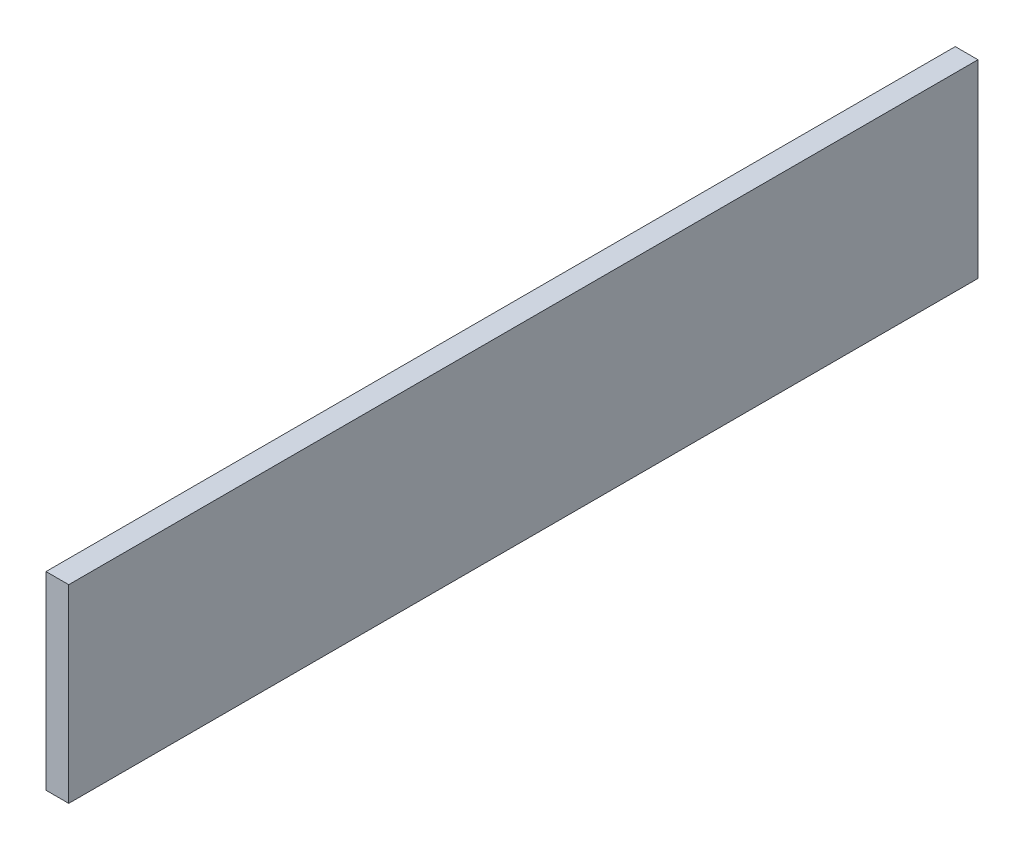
ISO-10303-21;
HEADER;
FILE_DESCRIPTION(('STEP AP214'),'2;1');
FILE_NAME('part.step','',(''),(''),'','','');
FILE_SCHEMA(('AUTOMOTIVE_DESIGN { 1 0 10303 214 1 1 1 1 }'));
ENDSEC;
DATA;
#1=APPLICATION_CONTEXT('core data for automotive mechanical design processes');
#2=APPLICATION_PROTOCOL_DEFINITION('international standard','automotive_design',2000,#1);
#3=PRODUCT_CONTEXT('',#1,'mechanical');
#4=PRODUCT('Part','Part','',(#3));
#5=PRODUCT_RELATED_PRODUCT_CATEGORY('part','',(#4));
#6=PRODUCT_DEFINITION_FORMATION('','',#4);
#7=PRODUCT_DEFINITION_CONTEXT('part definition',#1,'design');
#8=PRODUCT_DEFINITION('design','',#6,#7);
#9=PRODUCT_DEFINITION_SHAPE('','',#8);
#10=(LENGTH_UNIT() NAMED_UNIT(*) SI_UNIT(.MILLI.,.METRE.));
#11=(NAMED_UNIT(*) PLANE_ANGLE_UNIT() SI_UNIT($,.RADIAN.));
#12=(NAMED_UNIT(*) SI_UNIT($,.STERADIAN.) SOLID_ANGLE_UNIT());
#13=UNCERTAINTY_MEASURE_WITH_UNIT(LENGTH_MEASURE(1.E-05),#10,'distance_accuracy_value','');
#14=(GEOMETRIC_REPRESENTATION_CONTEXT(3) GLOBAL_UNCERTAINTY_ASSIGNED_CONTEXT((#13)) GLOBAL_UNIT_ASSIGNED_CONTEXT((#10,
#11,#12)) REPRESENTATION_CONTEXT('',''));
#15=CARTESIAN_POINT('',(0.,0.,0.));
#16=DIRECTION('',(0.,0.,1.));
#17=DIRECTION('',(1.,0.,0.));
#18=AXIS2_PLACEMENT_3D('',#15,#16,#17);
#19=CARTESIAN_POINT('',(1.5,120.,10.));
#20=DIRECTION('',(-1.,0.,0.));
#21=DIRECTION('',(0.,0.,1.));
#22=AXIS2_PLACEMENT_3D('',#19,#20,#21);
#23=PLANE('',#22);
#24=DIRECTION('',(0.,0.,-1.));
#25=VECTOR('',#24,1.);
#26=CARTESIAN_POINT('',(1.5,95.,10.));
#27=LINE('',#26,#25);
#28=CARTESIAN_POINT('',(1.5,95.,10.));
#29=VERTEX_POINT('',#28);
#30=CARTESIAN_POINT('',(1.5,95.,-110.));
#31=VERTEX_POINT('',#30);
#32=EDGE_CURVE('E90',#29,#31,#27,.T.);
#33=ORIENTED_EDGE('',*,*,#32,.T.);
#34=DIRECTION('',(0.,1.,0.));
#35=VECTOR('',#34,1.);
#36=CARTESIAN_POINT('',(1.5,120.,-110.));
#37=LINE('',#36,#35);
#38=CARTESIAN_POINT('',(1.5,120.,-110.));
#39=VERTEX_POINT('',#38);
#40=EDGE_CURVE('E85',#31,#39,#37,.T.);
#41=ORIENTED_EDGE('',*,*,#40,.T.);
#42=DIRECTION('',(0.,0.,-1.));
#43=VECTOR('',#42,1.);
#44=CARTESIAN_POINT('',(1.5,120.,10.));
#45=LINE('',#44,#43);
#46=CARTESIAN_POINT('',(1.5,120.,10.));
#47=VERTEX_POINT('',#46);
#48=EDGE_CURVE('E11',#47,#39,#45,.T.);
#49=ORIENTED_EDGE('',*,*,#48,.F.);
#50=DIRECTION('',(0.,1.,0.));
#51=VECTOR('',#50,1.);
#52=CARTESIAN_POINT('',(1.5,120.,10.));
#53=LINE('',#52,#51);
#54=EDGE_CURVE('E96',#29,#47,#53,.T.);
#55=ORIENTED_EDGE('',*,*,#54,.F.);
#56=EDGE_LOOP('',(#33,#41,#49,#55));
#57=FACE_BOUND('',#56,.T.);
#58=ADVANCED_FACE('F33',(#57),#23,.F.);
#59=CARTESIAN_POINT('',(1.5,120.,10.));
#60=DIRECTION('',(0.,-1.,0.));
#61=DIRECTION('',(0.,0.,-1.));
#62=AXIS2_PLACEMENT_3D('',#59,#60,#61);
#63=PLANE('',#62);
#64=ORIENTED_EDGE('',*,*,#48,.T.);
#65=DIRECTION('',(-1.,0.,0.));
#66=VECTOR('',#65,1.);
#67=CARTESIAN_POINT('',(1.5,120.,-110.));
#68=LINE('',#67,#66);
#69=CARTESIAN_POINT('',(-1.5,120.,-110.));
#70=VERTEX_POINT('',#69);
#71=EDGE_CURVE('E75',#39,#70,#68,.T.);
#72=ORIENTED_EDGE('',*,*,#71,.T.);
#73=DIRECTION('',(0.,0.,-1.));
#74=VECTOR('',#73,1.);
#75=CARTESIAN_POINT('',(-1.5,120.,10.));
#76=LINE('',#75,#74);
#77=CARTESIAN_POINT('',(-1.5,120.,10.));
#78=VERTEX_POINT('',#77);
#79=EDGE_CURVE('E40',#78,#70,#76,.T.);
#80=ORIENTED_EDGE('',*,*,#79,.F.);
#81=DIRECTION('',(-1.,0.,0.));
#82=VECTOR('',#81,1.);
#83=CARTESIAN_POINT('',(1.5,120.,10.));
#84=LINE('',#83,#82);
#85=EDGE_CURVE('E76',#47,#78,#84,.T.);
#86=ORIENTED_EDGE('',*,*,#85,.F.);
#87=EDGE_LOOP('',(#64,#72,#80,#86));
#88=FACE_BOUND('',#87,.T.);
#89=ADVANCED_FACE('F73',(#88),#63,.F.);
#90=CARTESIAN_POINT('',(-1.5,120.,10.));
#91=DIRECTION('',(1.,0.,0.));
#92=DIRECTION('',(0.,0.,-1.));
#93=AXIS2_PLACEMENT_3D('',#90,#91,#92);
#94=PLANE('',#93);
#95=ORIENTED_EDGE('',*,*,#79,.T.);
#96=DIRECTION('',(0.,-1.,0.));
#97=VECTOR('',#96,1.);
#98=CARTESIAN_POINT('',(-1.5,120.,-110.));
#99=LINE('',#98,#97);
#100=CARTESIAN_POINT('',(-1.5,95.,-110.));
#101=VERTEX_POINT('',#100);
#102=EDGE_CURVE('E88',#70,#101,#99,.T.);
#103=ORIENTED_EDGE('',*,*,#102,.T.);
#104=DIRECTION('',(0.,0.,-1.));
#105=VECTOR('',#104,1.);
#106=CARTESIAN_POINT('',(-1.5,95.,10.));
#107=LINE('',#106,#105);
#108=CARTESIAN_POINT('',(-1.5,95.,10.));
#109=VERTEX_POINT('',#108);
#110=EDGE_CURVE('E102',#109,#101,#107,.T.);
#111=ORIENTED_EDGE('',*,*,#110,.F.);
#112=DIRECTION('',(0.,-1.,0.));
#113=VECTOR('',#112,1.);
#114=CARTESIAN_POINT('',(-1.5,120.,10.));
#115=LINE('',#114,#113);
#116=EDGE_CURVE('E52',#78,#109,#115,.T.);
#117=ORIENTED_EDGE('',*,*,#116,.F.);
#118=EDGE_LOOP('',(#95,#103,#111,#117));
#119=FACE_BOUND('',#118,.T.);
#120=ADVANCED_FACE('F104',(#119),#94,.F.);
#121=CARTESIAN_POINT('',(1.5,95.,10.));
#122=DIRECTION('',(0.,1.,0.));
#123=DIRECTION('',(0.,0.,1.));
#124=AXIS2_PLACEMENT_3D('',#121,#122,#123);
#125=PLANE('',#124);
#126=ORIENTED_EDGE('',*,*,#110,.T.);
#127=DIRECTION('',(1.,0.,0.));
#128=VECTOR('',#127,1.);
#129=CARTESIAN_POINT('',(1.5,95.,-110.));
#130=LINE('',#129,#128);
#131=EDGE_CURVE('E94',#101,#31,#130,.T.);
#132=ORIENTED_EDGE('',*,*,#131,.T.);
#133=ORIENTED_EDGE('',*,*,#32,.F.);
#134=DIRECTION('',(1.,0.,0.));
#135=VECTOR('',#134,1.);
#136=CARTESIAN_POINT('',(1.5,95.,10.));
#137=LINE('',#136,#135);
#138=EDGE_CURVE('E47',#109,#29,#137,.T.);
#139=ORIENTED_EDGE('',*,*,#138,.F.);
#140=EDGE_LOOP('',(#126,#132,#133,#139));
#141=FACE_BOUND('',#140,.T.);
#142=ADVANCED_FACE('F106',(#141),#125,.F.);
#143=CARTESIAN_POINT('',(0.,0.,10.));
#144=DIRECTION('',(0.,0.,-1.));
#145=DIRECTION('',(-1.,0.,0.));
#146=AXIS2_PLACEMENT_3D('',#143,#144,#145);
#147=PLANE('',#146);
#148=ORIENTED_EDGE('',*,*,#54,.T.);
#149=ORIENTED_EDGE('',*,*,#85,.T.);
#150=ORIENTED_EDGE('',*,*,#116,.T.);
#151=ORIENTED_EDGE('',*,*,#138,.T.);
#152=EDGE_LOOP('',(#148,#149,#150,#151));
#153=FACE_BOUND('',#152,.T.);
#154=ADVANCED_FACE('F107',(#153),#147,.F.);
#155=CARTESIAN_POINT('',(0.,0.,-110.));
#156=DIRECTION('',(0.,0.,-1.));
#157=DIRECTION('',(-1.,0.,0.));
#158=AXIS2_PLACEMENT_3D('',#155,#156,#157);
#159=PLANE('',#158);
#160=ORIENTED_EDGE('',*,*,#40,.F.);
#161=ORIENTED_EDGE('',*,*,#131,.F.);
#162=ORIENTED_EDGE('',*,*,#102,.F.);
#163=ORIENTED_EDGE('',*,*,#71,.F.);
#164=EDGE_LOOP('',(#160,#161,#162,#163));
#165=FACE_BOUND('',#164,.T.);
#166=ADVANCED_FACE('F83',(#165),#159,.T.);
#167=CLOSED_SHELL('',(#58,#89,#120,#142,#154,#166));
#168=MANIFOLD_SOLID_BREP('B2',#167);
#169=ADVANCED_BREP_SHAPE_REPRESENTATION('',(#18,#168),#14);
#170=SHAPE_DEFINITION_REPRESENTATION(#9,#169);
ENDSEC;
END-ISO-10303-21;
